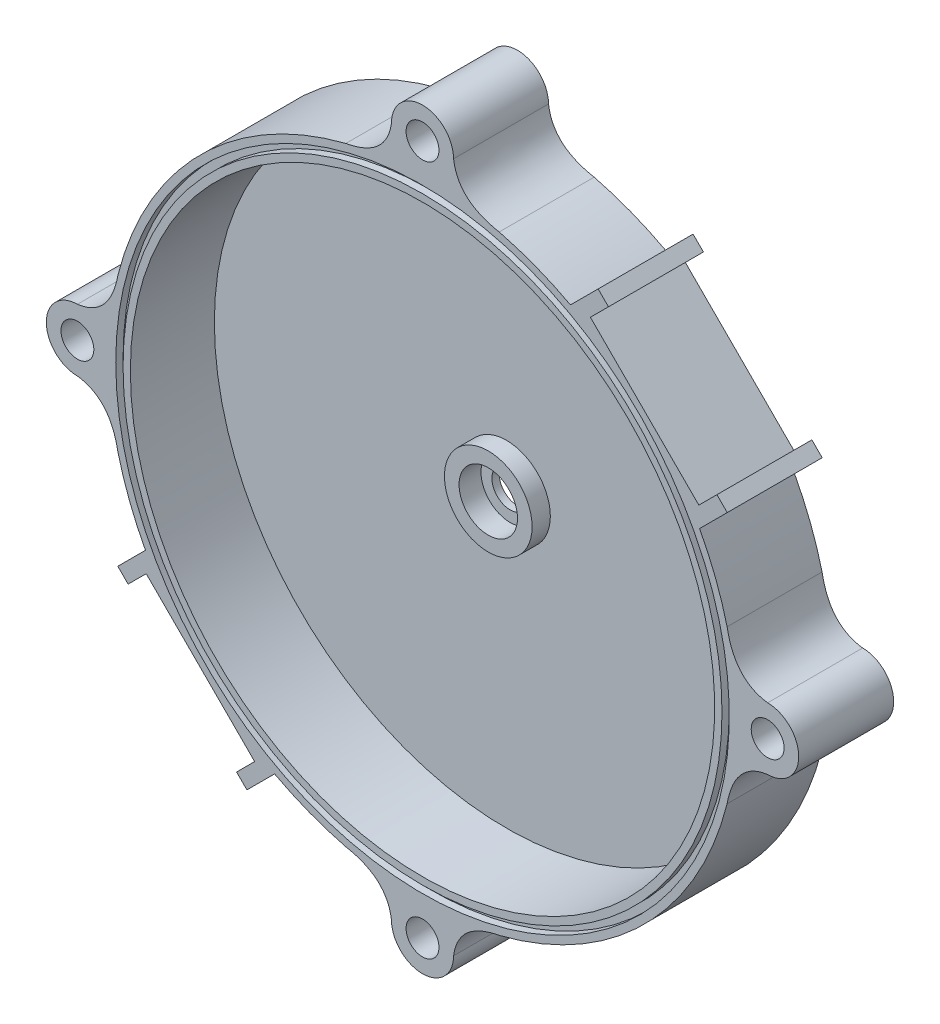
from build123d import *

# Parameters (mm, degrees)
SKIZZE1_R                        = 4
SKIZZE1_R_2                      = 2.5
AUFSATZ_LINEAR_AUSTRAGEN16_DEPTH = 1
SKIZZE1_23_R                     = 6
SKIZZE1_23_R_2                   = 4
AUFSATZ_LINEAR_AUSTRAGEN17_DEPTH = 4
SKIZZE1_24_R                     = 40
SKIZZE1_24_R_2                   = 6
AUFSATZ_LINEAR_AUSTRAGEN18_DEPTH = 1.5
SKIZZE1_27_R                     = 42
SKIZZE1_27_R_2                   = 41
SKIZZE1_27_R_3                   = 40
SKIZZE1_27_R_4                   = 2.25
AUFSATZ_LINEAR_AUSTRAGEN19_DEPTH = 13
SKIZZE1_29_R                     = 42
SKIZZE1_29_R_2                   = 41
AUFSATZ_LINEAR_AUSTRAGEN20_DEPTH = 12


with BuildPart() as part:
    # Skizze1 → Aufsatz-Linear austragen16 (new body)
    with BuildSketch(Plane.XY):
        Circle(SKIZZE1_R)
        Circle(SKIZZE1_R_2, mode=Mode.SUBTRACT)
    extrude(amount=AUFSATZ_LINEAR_AUSTRAGEN16_DEPTH)

    # Skizze1_23 → Aufsatz-Linear austragen17 (add)
    with BuildSketch(Plane.XY):
        Circle(SKIZZE1_23_R)
        Circle(SKIZZE1_23_R_2, mode=Mode.SUBTRACT)
    extrude(amount=AUFSATZ_LINEAR_AUSTRAGEN17_DEPTH)

    # Skizze1_24 → Aufsatz-Linear austragen18 (add)
    with BuildSketch(Plane.XY):
        Circle(SKIZZE1_24_R)
        Circle(SKIZZE1_24_R_2, mode=Mode.SUBTRACT)
    extrude(amount=AUFSATZ_LINEAR_AUSTRAGEN18_DEPTH)

    # Skizze1_27 → Aufsatz-Linear austragen19 (add)
    # profile 1 of 10: a face of its own
    with BuildSketch(Plane.XY):
        with BuildLine():
            ThreePointArc((37.931359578, 20.253690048), (34.543450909, 25.607616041), (30.405591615, 30.405591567))
            ThreePointArc((30.405591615, 30.405591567), (25.607616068, 34.543450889), (20.253690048, 37.931359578))
            ThreePointArc((20.253690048, 37.931359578), (15.489340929, 40.113343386), (10.494954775, 41.699591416))
            add(Edge.make_bspline(
                [(9.142071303, 42.016931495), (9.777808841, 41.829977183), (10.494954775, 41.699591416)],
                knots=[0.872857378, 0.872857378, 0.872857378, 1, 1, 1], degree=2))
            ThreePointArc((9.142071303, 42.016931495), (0, 43), (-9.142071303, 42.016931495))
            add(Edge.make_bspline(
                [(-9.142071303, 42.016931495), (-9.777808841, 41.829977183), (-10.494954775, 41.699591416)],
                knots=[0.872857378, 0.872857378, 0.872857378, 1, 1, 1], degree=2))
            ThreePointArc((-10.494954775, 41.699591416), (-30.405591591, 30.405591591), (-41.699591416, 10.494954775))
            add(Edge.make_bspline(
                [(-42.016931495, 9.142071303), (-41.829977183, 9.77780884), (-41.699591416, 10.494954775)],
                knots=[0.872857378, 0.872857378, 0.872857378, 1, 1, 1], degree=2))
            ThreePointArc((-42.016931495, 9.142071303), (-43, 0), (-42.016931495, -9.142071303))
            add(Edge.make_bspline(
                [(-42.016931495, -9.142071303), (-41.829977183, -9.77780884), (-41.699591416, -10.494954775)],
                knots=[0.872857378, 0.872857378, 0.872857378, 1, 1, 1], degree=2))
            ThreePointArc((-41.699591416, -10.494954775), (-40.113343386, -15.489340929), (-37.931359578, -20.253690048))
            ThreePointArc((-37.931359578, -20.253690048), (-34.543450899, -25.607616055), (-30.405591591, -30.405591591))
            ThreePointArc((-30.405591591, -30.405591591), (-25.607616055, -34.543450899), (-20.253690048, -37.931359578))
            ThreePointArc((-20.253690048, -37.931359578), (-15.489340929, -40.113343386), (-10.494954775, -41.699591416))
            add(Edge.make_bspline(
                [(-9.142071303, -42.016931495), (-9.77780884, -41.829977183), (-10.494954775, -41.699591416)],
                knots=[0.872857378, 0.872857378, 0.872857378, 1, 1, 1], degree=2))
            ThreePointArc((-9.142071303, -42.016931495), (0, -43), (9.142071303, -42.016931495))
            add(Edge.make_bspline(
                [(9.142071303, -42.016931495), (9.77780884, -41.829977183), (10.494954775, -41.699591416)],
                knots=[0.872857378, 0.872857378, 0.872857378, 1, 1, 1], degree=2))
            ThreePointArc((10.494954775, -41.699591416), (30.405591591, -30.405591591), (41.699591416, -10.494954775))
            add(Edge.make_bspline(
                [(42.016931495, -9.142071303), (41.829977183, -9.77780884), (41.699591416, -10.494954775)],
                knots=[0.872857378, 0.872857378, 0.872857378, 1, 1, 1], degree=2))
            ThreePointArc((42.016931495, -9.142071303), (42.753526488, -4.597387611), (43, 0))
            ThreePointArc((43, 0), (42.753526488, 4.597387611), (42.016931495, 9.142071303))
            add(Edge.make_bspline(
                [(42.016931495, 9.142071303), (41.829977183, 9.777808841), (41.699591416, 10.494954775)],
                knots=[0.872857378, 0.872857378, 0.872857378, 1, 1, 1], degree=2))
            ThreePointArc((41.699591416, 10.494954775), (40.113343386, 15.489340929), (37.931359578, 20.253690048))
        make_face()
        with Locations(Location((0, 0, 0), (0, 0, 180))):
            Circle(SKIZZE1_27_R, mode=Mode.SUBTRACT)
    # profile 2 of 10: a face of its own
    with BuildSketch(Plane.XY):
        with Locations(Location((0, 0, 0), (0, 0, 180))):
            Circle(SKIZZE1_27_R_2)
        with Locations(Location((0, 0, 0), (0, 0, 180))):
            Circle(SKIZZE1_27_R_3, mode=Mode.SUBTRACT)
    # profile 3 of 10: a face of its own
    with BuildSketch(Plane.XY):
        with BuildLine():
            add(Edge.make_bspline(
                [(4.25, -47.25), (4.777616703, -43.30040708), (9.142071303, -42.016931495)],
                knots=[0, 0, 0, 0.872857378, 0.872857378, 0.872857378], degree=2))
            ThreePointArc((9.142071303, -42.016931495), (0, -43), (-9.142071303, -42.016931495))
            add(Edge.make_bspline(
                [(-4.25, -47.25), (-4.777616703, -43.30040708), (-9.142071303, -42.016931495)],
                knots=[0, 0, 0, 0.872857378, 0.872857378, 0.872857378], degree=2))
            ThreePointArc((-4.25, -47.25), (0, -51.5), (4.25, -47.25))
        make_face()
        with Locations(Location((0, -47.25, 0), (0, 0, 180))):
            Circle(SKIZZE1_27_R_4, mode=Mode.SUBTRACT)
    # profile 4 of 10: a face of its own
    with BuildSketch(Plane.XY):
        with BuildLine():
            add(Edge.make_bspline(
                [(47.25, 4.25), (43.30040708, 4.777616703), (42.016931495, 9.142071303)],
                knots=[0, 0, 0, 0.872857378, 0.872857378, 0.872857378], degree=2))
            ThreePointArc((42.016931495, 9.142071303), (42.753526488, 4.597387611), (43, 0))
            ThreePointArc((43, 0), (42.753526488, -4.597387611), (42.016931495, -9.142071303))
            add(Edge.make_bspline(
                [(47.25, -4.25), (43.30040708, -4.777616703), (42.016931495, -9.142071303)],
                knots=[0, 0, 0, 0.872857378, 0.872857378, 0.872857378], degree=2))
            ThreePointArc((47.25, -4.25), (51.5, 0), (47.25, 4.25))
        make_face()
        with Locations(Location((47.25, 0, 0), (0, 0, 180))):
            Circle(SKIZZE1_27_R_4, mode=Mode.SUBTRACT)
    # profile 5 of 10: a face of its own
    with BuildSketch(Plane.XY):
        with BuildLine():
            Line((40.305086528, 25.455844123), (37.830212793, 22.980970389))
            Line((37.830212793, 22.980970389), (30.405591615, 30.405591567))
            ThreePointArc((30.405591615, 30.405591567), (34.543450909, 25.607616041), (37.931359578, 20.253690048))
            Line((37.931359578, 20.253690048), (41.71930009, 24.04163056))
            Line((41.71930009, 24.04163056), (40.305086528, 25.455844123))
        make_face()
    # profile 6 of 10: a face of its own
    with BuildSketch(Plane.XY):
        with BuildLine():
            ThreePointArc((20.253690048, 37.931359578), (25.607616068, 34.543450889), (30.405591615, 30.405591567))
            Line((30.405591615, 30.405591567), (22.980970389, 37.830212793))
            Line((22.980970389, 37.830212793), (25.455844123, 40.305086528))
            Line((25.455844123, 40.305086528), (24.04163056, 41.71930009))
            Line((24.04163056, 41.71930009), (20.253690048, 37.931359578))
        make_face()
    # profile 7 of 10: a face of its own
    with BuildSketch(Plane.XY):
        with BuildLine():
            ThreePointArc((-30.405591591, -30.405591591), (-34.543450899, -25.607616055), (-37.931359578, -20.253690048))
            Line((-37.931359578, -20.253690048), (-41.71930009, -24.04163056))
            Line((-41.71930009, -24.04163056), (-40.305086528, -25.455844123))
            Line((-40.305086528, -25.455844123), (-37.830212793, -22.980970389))
            Line((-37.830212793, -22.980970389), (-30.405591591, -30.405591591))
        make_face()
    # profile 8 of 10: a face of its own
    with BuildSketch(Plane.XY):
        with BuildLine():
            Line((-24.04163056, -41.71930009), (-20.253690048, -37.931359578))
            ThreePointArc((-20.253690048, -37.931359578), (-25.607616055, -34.543450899), (-30.405591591, -30.405591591))
            Line((-30.405591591, -30.405591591), (-22.980970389, -37.830212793))
            Line((-22.980970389, -37.830212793), (-25.455844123, -40.305086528))
            Line((-25.455844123, -40.305086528), (-24.04163056, -41.71930009))
        make_face()
    # profile 9 of 10: a face of its own
    with BuildSketch(Plane.XY):
        with BuildLine():
            ThreePointArc((-42.016931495, -9.142071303), (-43, 0), (-42.016931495, 9.142071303))
            add(Edge.make_bspline(
                [(-47.25, 4.25), (-43.30040708, 4.777616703), (-42.016931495, 9.142071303)],
                knots=[0, 0, 0, 0.872857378, 0.872857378, 0.872857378], degree=2))
            ThreePointArc((-47.25, 4.25), (-51.5, 0), (-47.25, -4.25))
            add(Edge.make_bspline(
                [(-47.25, -4.25), (-43.30040708, -4.777616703), (-42.016931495, -9.142071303)],
                knots=[0, 0, 0, 0.872857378, 0.872857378, 0.872857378], degree=2))
        make_face()
        with Locations(Location((-47.25, 0, 0), (0, 0, 180))):
            Circle(SKIZZE1_27_R_4, mode=Mode.SUBTRACT)
    # profile 10 of 10: a face of its own
    with BuildSketch(Plane.XY):
        with BuildLine():
            ThreePointArc((-9.142071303, 42.016931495), (0, 43), (9.142071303, 42.016931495))
            add(Edge.make_bspline(
                [(4.25, 47.25), (4.777616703, 43.30040708), (9.142071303, 42.016931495)],
                knots=[0, 0, 0, 0.872857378, 0.872857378, 0.872857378], degree=2))
            ThreePointArc((4.25, 47.25), (0, 51.5), (-4.25, 47.25))
            add(Edge.make_bspline(
                [(-4.25, 47.25), (-4.777616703, 43.30040708), (-9.142071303, 42.016931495)],
                knots=[0, 0, 0, 0.872857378, 0.872857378, 0.872857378], degree=2))
        make_face()
        with Locations(Location((0, 47.25, 0), (0, 0, 180))):
            Circle(SKIZZE1_27_R_4, mode=Mode.SUBTRACT)
    extrude(amount=AUFSATZ_LINEAR_AUSTRAGEN19_DEPTH)


with BuildPart() as aufsatz_linear_austragen19_piece_1:
    # of the separate pieces the step leaves, piece 1, a body of its own (aufsatz_linear_austragen19_pieces)
    add(part.part.solids().sort_by_distance((2.5, 0, 0))[0])



with BuildPart() as aufsatz_linear_austragen19_piece_2:
    # of the separate pieces the step leaves, piece 2, a body of its own (aufsatz_linear_austragen19_pieces)
    add(part.part.solids().sort_by_distance((41.699591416, -10.494954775, 0))[0])


with BuildPart() as aufsatz_linear_austragen19_piece_1_1:
    add(aufsatz_linear_austragen19_piece_1.part)

    add(aufsatz_linear_austragen19_piece_2.part)  # Aufsatz-Linear austragen20 merges Aufsatz-Linear austragen19 piece 2
    # Skizze1_29 → Aufsatz-Linear austragen20 (add)
    with BuildSketch(Plane.XY):
        with Locations(Location((0, 0, 0), (0, 0, 180))):
            Circle(SKIZZE1_29_R)
        with Locations(Location((0, 0, 0), (0, 0, 180))):
            Circle(SKIZZE1_29_R_2, mode=Mode.SUBTRACT)
    extrude(amount=AUFSATZ_LINEAR_AUSTRAGEN20_DEPTH)


solid = aufsatz_linear_austragen19_piece_1_1.part
